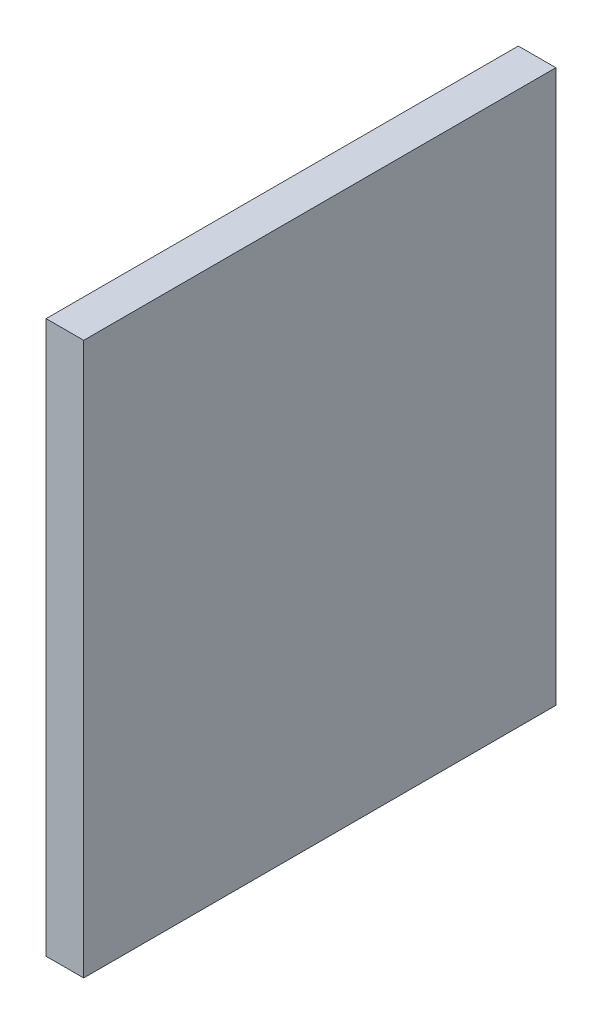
ISO-10303-21;
HEADER;
FILE_DESCRIPTION(('STEP AP214'),'2;1');
FILE_NAME('part.step','',(''),(''),'','','');
FILE_SCHEMA(('AUTOMOTIVE_DESIGN { 1 0 10303 214 1 1 1 1 }'));
ENDSEC;
DATA;
#1=APPLICATION_CONTEXT('core data for automotive mechanical design processes');
#2=APPLICATION_PROTOCOL_DEFINITION('international standard','automotive_design',2000,#1);
#3=PRODUCT_CONTEXT('',#1,'mechanical');
#4=PRODUCT('Part','Part','',(#3));
#5=PRODUCT_RELATED_PRODUCT_CATEGORY('part','',(#4));
#6=PRODUCT_DEFINITION_FORMATION('','',#4);
#7=PRODUCT_DEFINITION_CONTEXT('part definition',#1,'design');
#8=PRODUCT_DEFINITION('design','',#6,#7);
#9=PRODUCT_DEFINITION_SHAPE('','',#8);
#10=(LENGTH_UNIT() NAMED_UNIT(*) SI_UNIT(.MILLI.,.METRE.));
#11=(NAMED_UNIT(*) PLANE_ANGLE_UNIT() SI_UNIT($,.RADIAN.));
#12=(NAMED_UNIT(*) SI_UNIT($,.STERADIAN.) SOLID_ANGLE_UNIT());
#13=UNCERTAINTY_MEASURE_WITH_UNIT(LENGTH_MEASURE(1.E-05),#10,'distance_accuracy_value','');
#14=(GEOMETRIC_REPRESENTATION_CONTEXT(3) GLOBAL_UNCERTAINTY_ASSIGNED_CONTEXT((#13)) GLOBAL_UNIT_ASSIGNED_CONTEXT((#10,
#11,#12)) REPRESENTATION_CONTEXT('',''));
#15=CARTESIAN_POINT('',(0.,0.,0.));
#16=DIRECTION('',(0.,0.,1.));
#17=DIRECTION('',(1.,0.,0.));
#18=AXIS2_PLACEMENT_3D('',#15,#16,#17);
#19=CARTESIAN_POINT('',(16.,117.6,-100.55));
#20=DIRECTION('',(0.,0.,1.));
#21=DIRECTION('',(0.,-1.,0.));
#22=AXIS2_PLACEMENT_3D('',#19,#20,#21);
#23=PLANE('',#22);
#24=DIRECTION('',(0.,1.,0.));
#25=VECTOR('',#24,1.);
#26=CARTESIAN_POINT('',(0.,117.6,-100.55));
#27=LINE('',#26,#25);
#28=CARTESIAN_POINT('',(0.,-117.6,-100.55));
#29=VERTEX_POINT('',#28);
#30=CARTESIAN_POINT('',(0.,117.6,-100.55));
#31=VERTEX_POINT('',#30);
#32=EDGE_CURVE('E91',#29,#31,#27,.T.);
#33=ORIENTED_EDGE('',*,*,#32,.T.);
#34=DIRECTION('',(-1.,0.,0.));
#35=VECTOR('',#34,1.);
#36=CARTESIAN_POINT('',(16.,117.6,-100.55));
#37=LINE('',#36,#35);
#38=CARTESIAN_POINT('',(16.,117.6,-100.55));
#39=VERTEX_POINT('',#38);
#40=EDGE_CURVE('E11',#39,#31,#37,.T.);
#41=ORIENTED_EDGE('',*,*,#40,.F.);
#42=DIRECTION('',(0.,1.,0.));
#43=VECTOR('',#42,1.);
#44=CARTESIAN_POINT('',(16.,117.6,-100.55));
#45=LINE('',#44,#43);
#46=CARTESIAN_POINT('',(16.,-117.6,-100.55));
#47=VERTEX_POINT('',#46);
#48=EDGE_CURVE('E79',#47,#39,#45,.T.);
#49=ORIENTED_EDGE('',*,*,#48,.F.);
#50=DIRECTION('',(-1.,0.,0.));
#51=VECTOR('',#50,1.);
#52=CARTESIAN_POINT('',(16.,-117.6,-100.55));
#53=LINE('',#52,#51);
#54=EDGE_CURVE('E87',#47,#29,#53,.T.);
#55=ORIENTED_EDGE('',*,*,#54,.T.);
#56=EDGE_LOOP('',(#33,#41,#49,#55));
#57=FACE_BOUND('',#56,.T.);
#58=ADVANCED_FACE('F28',(#57),#23,.F.);
#59=CARTESIAN_POINT('',(16.,117.6,100.55));
#60=DIRECTION('',(0.,-1.,0.));
#61=DIRECTION('',(0.,0.,-1.));
#62=AXIS2_PLACEMENT_3D('',#59,#60,#61);
#63=PLANE('',#62);
#64=DIRECTION('',(0.,0.,1.));
#65=VECTOR('',#64,1.);
#66=CARTESIAN_POINT('',(0.,117.6,100.55));
#67=LINE('',#66,#65);
#68=CARTESIAN_POINT('',(0.,117.6,100.55));
#69=VERTEX_POINT('',#68);
#70=EDGE_CURVE('E83',#31,#69,#67,.T.);
#71=ORIENTED_EDGE('',*,*,#70,.T.);
#72=DIRECTION('',(-1.,0.,0.));
#73=VECTOR('',#72,1.);
#74=CARTESIAN_POINT('',(16.,117.6,100.55));
#75=LINE('',#74,#73);
#76=CARTESIAN_POINT('',(16.,117.6,100.55));
#77=VERTEX_POINT('',#76);
#78=EDGE_CURVE('E36',#77,#69,#75,.T.);
#79=ORIENTED_EDGE('',*,*,#78,.F.);
#80=DIRECTION('',(0.,0.,1.));
#81=VECTOR('',#80,1.);
#82=CARTESIAN_POINT('',(16.,117.6,100.55));
#83=LINE('',#82,#81);
#84=EDGE_CURVE('E74',#39,#77,#83,.T.);
#85=ORIENTED_EDGE('',*,*,#84,.F.);
#86=ORIENTED_EDGE('',*,*,#40,.T.);
#87=EDGE_LOOP('',(#71,#79,#85,#86));
#88=FACE_BOUND('',#87,.T.);
#89=ADVANCED_FACE('F82',(#88),#63,.F.);
#90=CARTESIAN_POINT('',(16.,117.6,100.55));
#91=DIRECTION('',(0.,0.,-1.));
#92=DIRECTION('',(0.,1.,0.));
#93=AXIS2_PLACEMENT_3D('',#90,#91,#92);
#94=PLANE('',#93);
#95=DIRECTION('',(0.,-1.,0.));
#96=VECTOR('',#95,1.);
#97=CARTESIAN_POINT('',(0.,117.6,100.55));
#98=LINE('',#97,#96);
#99=CARTESIAN_POINT('',(0.,-117.6,100.55));
#100=VERTEX_POINT('',#99);
#101=EDGE_CURVE('E61',#69,#100,#98,.T.);
#102=ORIENTED_EDGE('',*,*,#101,.T.);
#103=DIRECTION('',(-1.,0.,0.));
#104=VECTOR('',#103,1.);
#105=CARTESIAN_POINT('',(16.,-117.6,100.55));
#106=LINE('',#105,#104);
#107=CARTESIAN_POINT('',(16.,-117.6,100.55));
#108=VERTEX_POINT('',#107);
#109=EDGE_CURVE('E84',#108,#100,#106,.T.);
#110=ORIENTED_EDGE('',*,*,#109,.F.);
#111=DIRECTION('',(0.,-1.,0.));
#112=VECTOR('',#111,1.);
#113=CARTESIAN_POINT('',(16.,117.6,100.55));
#114=LINE('',#113,#112);
#115=EDGE_CURVE('E77',#77,#108,#114,.T.);
#116=ORIENTED_EDGE('',*,*,#115,.F.);
#117=ORIENTED_EDGE('',*,*,#78,.T.);
#118=EDGE_LOOP('',(#102,#110,#116,#117));
#119=FACE_BOUND('',#118,.T.);
#120=ADVANCED_FACE('F85',(#119),#94,.F.);
#121=CARTESIAN_POINT('',(16.,-117.6,100.55));
#122=DIRECTION('',(0.,1.,0.));
#123=DIRECTION('',(0.,0.,1.));
#124=AXIS2_PLACEMENT_3D('',#121,#122,#123);
#125=PLANE('',#124);
#126=DIRECTION('',(0.,0.,-1.));
#127=VECTOR('',#126,1.);
#128=CARTESIAN_POINT('',(0.,-117.6,100.55));
#129=LINE('',#128,#127);
#130=EDGE_CURVE('E67',#100,#29,#129,.T.);
#131=ORIENTED_EDGE('',*,*,#130,.T.);
#132=ORIENTED_EDGE('',*,*,#54,.F.);
#133=DIRECTION('',(0.,0.,-1.));
#134=VECTOR('',#133,1.);
#135=CARTESIAN_POINT('',(16.,-117.6,100.55));
#136=LINE('',#135,#134);
#137=EDGE_CURVE('E44',#108,#47,#136,.T.);
#138=ORIENTED_EDGE('',*,*,#137,.F.);
#139=ORIENTED_EDGE('',*,*,#109,.T.);
#140=EDGE_LOOP('',(#131,#132,#138,#139));
#141=FACE_BOUND('',#140,.T.);
#142=ADVANCED_FACE('F98',(#141),#125,.F.);
#143=CARTESIAN_POINT('',(16.,-117.6,-100.55));
#144=DIRECTION('',(1.,0.,0.));
#145=DIRECTION('',(0.,0.,-1.));
#146=AXIS2_PLACEMENT_3D('',#143,#144,#145);
#147=PLANE('',#146);
#148=ORIENTED_EDGE('',*,*,#48,.T.);
#149=ORIENTED_EDGE('',*,*,#84,.T.);
#150=ORIENTED_EDGE('',*,*,#115,.T.);
#151=ORIENTED_EDGE('',*,*,#137,.T.);
#152=EDGE_LOOP('',(#148,#149,#150,#151));
#153=FACE_BOUND('',#152,.T.);
#154=ADVANCED_FACE('F75',(#153),#147,.T.);
#155=CARTESIAN_POINT('',(0.,-117.6,-100.55));
#156=DIRECTION('',(1.,0.,0.));
#157=DIRECTION('',(0.,0.,-1.));
#158=AXIS2_PLACEMENT_3D('',#155,#156,#157);
#159=PLANE('',#158);
#160=ORIENTED_EDGE('',*,*,#32,.F.);
#161=ORIENTED_EDGE('',*,*,#130,.F.);
#162=ORIENTED_EDGE('',*,*,#101,.F.);
#163=ORIENTED_EDGE('',*,*,#70,.F.);
#164=EDGE_LOOP('',(#160,#161,#162,#163));
#165=FACE_BOUND('',#164,.T.);
#166=ADVANCED_FACE('F101',(#165),#159,.F.);
#167=CLOSED_SHELL('',(#58,#89,#120,#142,#154,#166));
#168=MANIFOLD_SOLID_BREP('B2',#167);
#169=ADVANCED_BREP_SHAPE_REPRESENTATION('',(#18,#168),#14);
#170=SHAPE_DEFINITION_REPRESENTATION(#9,#169);
ENDSEC;
END-ISO-10303-21;
